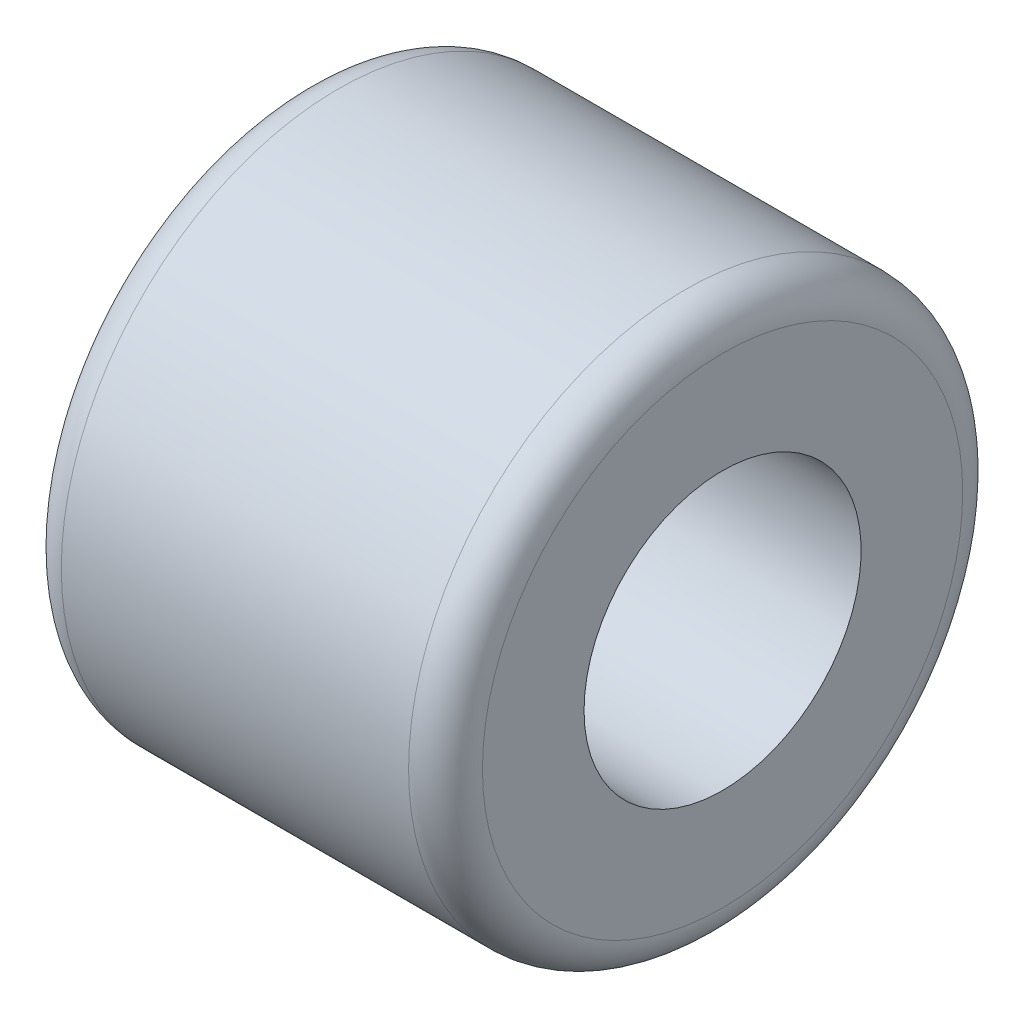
from build123d import *


with BuildPart() as part:
    # Sketch 1 → Revolve 1 (revolve)
    with BuildSketch(Plane.XY, mode=Mode.PRIVATE) as revolve_1_sk:
        with BuildLine():
            Line((-19, 12.5), (19, 12.5))
            Line((19, 12.5), (19, 21.666666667))
            ThreePointArc((19, 21.666666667), (18.023689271, 24.023689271), (15.666666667, 25))
            Line((15.666666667, 25), (-15.666666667, 25))
            ThreePointArc((-15.666666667, 25), (-18.023689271, 24.023689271), (-19, 21.666666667))
            Line((-19, 21.666666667), (-19, 12.5))
        make_face()
    revolve(revolve_1_sk.sketch.rotate(Axis((50, 0, 0), (-1, 0, 0)), 270), axis=Axis((50, 0, 0), (-1, 0, 0)))


solid = part.part
